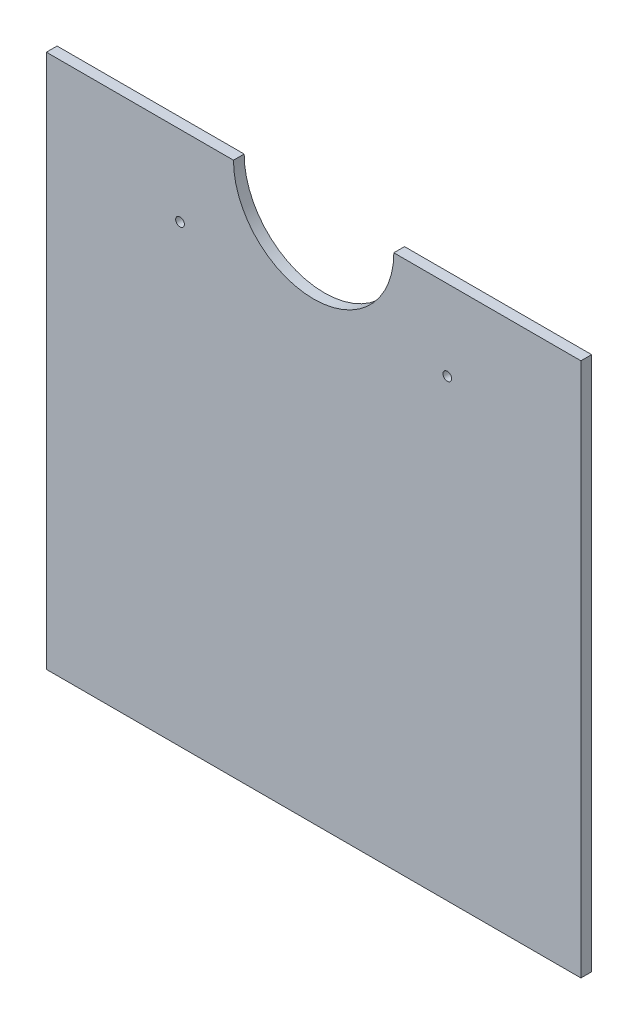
ISO-10303-21;
HEADER;
FILE_DESCRIPTION(('STEP AP214'),'2;1');
FILE_NAME('part.step','',(''),(''),'','','');
FILE_SCHEMA(('AUTOMOTIVE_DESIGN { 1 0 10303 214 1 1 1 1 }'));
ENDSEC;
DATA;
#1=APPLICATION_CONTEXT('core data for automotive mechanical design processes');
#2=APPLICATION_PROTOCOL_DEFINITION('international standard','automotive_design',2000,#1);
#3=PRODUCT_CONTEXT('',#1,'mechanical');
#4=PRODUCT('Part','Part','',(#3));
#5=PRODUCT_RELATED_PRODUCT_CATEGORY('part','',(#4));
#6=PRODUCT_DEFINITION_FORMATION('','',#4);
#7=PRODUCT_DEFINITION_CONTEXT('part definition',#1,'design');
#8=PRODUCT_DEFINITION('design','',#6,#7);
#9=PRODUCT_DEFINITION_SHAPE('','',#8);
#10=(LENGTH_UNIT() NAMED_UNIT(*) SI_UNIT(.MILLI.,.METRE.));
#11=(NAMED_UNIT(*) PLANE_ANGLE_UNIT() SI_UNIT($,.RADIAN.));
#12=(NAMED_UNIT(*) SI_UNIT($,.STERADIAN.) SOLID_ANGLE_UNIT());
#13=UNCERTAINTY_MEASURE_WITH_UNIT(LENGTH_MEASURE(1.E-05),#10,'distance_accuracy_value','');
#14=(GEOMETRIC_REPRESENTATION_CONTEXT(3) GLOBAL_UNCERTAINTY_ASSIGNED_CONTEXT((#13)) GLOBAL_UNIT_ASSIGNED_CONTEXT((#10,
#11,#12)) REPRESENTATION_CONTEXT('',''));
#15=CARTESIAN_POINT('',(0.,0.,0.));
#16=DIRECTION('',(0.,0.,1.));
#17=DIRECTION('',(1.,0.,0.));
#18=AXIS2_PLACEMENT_3D('',#15,#16,#17);
#19=CARTESIAN_POINT('',(0.,80.,8.));
#20=DIRECTION('',(1.,0.,0.));
#21=DIRECTION('',(0.,0.,-1.));
#22=AXIS2_PLACEMENT_3D('',#19,#20,#21);
#23=PLANE('',#22);
#24=DIRECTION('',(0.,-1.,0.));
#25=VECTOR('',#24,1.);
#26=CARTESIAN_POINT('',(0.,80.,0.));
#27=LINE('',#26,#25);
#28=CARTESIAN_POINT('',(0.,480.,0.));
#29=VERTEX_POINT('',#28);
#30=CARTESIAN_POINT('',(0.,80.,0.));
#31=VERTEX_POINT('',#30);
#32=EDGE_CURVE('E89',#29,#31,#27,.T.);
#33=ORIENTED_EDGE('',*,*,#32,.T.);
#34=DIRECTION('',(0.,0.,-1.));
#35=VECTOR('',#34,1.);
#36=CARTESIAN_POINT('',(0.,80.,8.));
#37=LINE('',#36,#35);
#38=CARTESIAN_POINT('',(0.,80.,8.));
#39=VERTEX_POINT('',#38);
#40=EDGE_CURVE('E11',#39,#31,#37,.T.);
#41=ORIENTED_EDGE('',*,*,#40,.F.);
#42=DIRECTION('',(0.,-1.,0.));
#43=VECTOR('',#42,1.);
#44=CARTESIAN_POINT('',(0.,80.,8.));
#45=LINE('',#44,#43);
#46=CARTESIAN_POINT('',(0.,480.,8.));
#47=VERTEX_POINT('',#46);
#48=EDGE_CURVE('E117',#47,#39,#45,.T.);
#49=ORIENTED_EDGE('',*,*,#48,.F.);
#50=DIRECTION('',(0.,0.,-1.));
#51=VECTOR('',#50,1.);
#52=CARTESIAN_POINT('',(0.,480.,8.));
#53=LINE('',#52,#51);
#54=EDGE_CURVE('E102',#47,#29,#53,.T.);
#55=ORIENTED_EDGE('',*,*,#54,.T.);
#56=EDGE_LOOP('',(#33,#41,#49,#55));
#57=FACE_BOUND('',#56,.T.);
#58=ADVANCED_FACE('F31',(#57),#23,.F.);
#59=CARTESIAN_POINT('',(0.,80.,8.));
#60=DIRECTION('',(0.,1.,0.));
#61=DIRECTION('',(0.,0.,1.));
#62=AXIS2_PLACEMENT_3D('',#59,#60,#61);
#63=PLANE('',#62);
#64=DIRECTION('',(1.,0.,0.));
#65=VECTOR('',#64,1.);
#66=CARTESIAN_POINT('',(0.,80.,0.));
#67=LINE('',#66,#65);
#68=CARTESIAN_POINT('',(400.,80.,0.));
#69=VERTEX_POINT('',#68);
#70=EDGE_CURVE('E85',#31,#69,#67,.T.);
#71=ORIENTED_EDGE('',*,*,#70,.T.);
#72=DIRECTION('',(0.,0.,-1.));
#73=VECTOR('',#72,1.);
#74=CARTESIAN_POINT('',(400.,80.,8.));
#75=LINE('',#74,#73);
#76=CARTESIAN_POINT('',(400.,80.,8.));
#77=VERTEX_POINT('',#76);
#78=EDGE_CURVE('E38',#77,#69,#75,.T.);
#79=ORIENTED_EDGE('',*,*,#78,.F.);
#80=DIRECTION('',(1.,0.,0.));
#81=VECTOR('',#80,1.);
#82=CARTESIAN_POINT('',(0.,80.,8.));
#83=LINE('',#82,#81);
#84=EDGE_CURVE('E98',#39,#77,#83,.T.);
#85=ORIENTED_EDGE('',*,*,#84,.F.);
#86=ORIENTED_EDGE('',*,*,#40,.T.);
#87=EDGE_LOOP('',(#71,#79,#85,#86));
#88=FACE_BOUND('',#87,.T.);
#89=ADVANCED_FACE('F97',(#88),#63,.F.);
#90=CARTESIAN_POINT('',(400.,80.,8.));
#91=DIRECTION('',(-1.,0.,0.));
#92=DIRECTION('',(0.,0.,1.));
#93=AXIS2_PLACEMENT_3D('',#90,#91,#92);
#94=PLANE('',#93);
#95=DIRECTION('',(0.,1.,0.));
#96=VECTOR('',#95,1.);
#97=CARTESIAN_POINT('',(400.,80.,0.));
#98=LINE('',#97,#96);
#99=CARTESIAN_POINT('',(400.,480.,0.));
#100=VERTEX_POINT('',#99);
#101=EDGE_CURVE('E91',#69,#100,#98,.T.);
#102=ORIENTED_EDGE('',*,*,#101,.T.);
#103=DIRECTION('',(0.,0.,-1.));
#104=VECTOR('',#103,1.);
#105=CARTESIAN_POINT('',(400.,480.,8.));
#106=LINE('',#105,#104);
#107=CARTESIAN_POINT('',(400.,480.,8.));
#108=VERTEX_POINT('',#107);
#109=EDGE_CURVE('E135',#108,#100,#106,.T.);
#110=ORIENTED_EDGE('',*,*,#109,.F.);
#111=DIRECTION('',(0.,1.,0.));
#112=VECTOR('',#111,1.);
#113=CARTESIAN_POINT('',(400.,80.,8.));
#114=LINE('',#113,#112);
#115=EDGE_CURVE('E121',#77,#108,#114,.T.);
#116=ORIENTED_EDGE('',*,*,#115,.F.);
#117=ORIENTED_EDGE('',*,*,#78,.T.);
#118=EDGE_LOOP('',(#102,#110,#116,#117));
#119=FACE_BOUND('',#118,.T.);
#120=ADVANCED_FACE('F143',(#119),#94,.F.);
#121=CARTESIAN_POINT('',(260.,480.,8.));
#122=DIRECTION('',(0.,-1.,0.));
#123=DIRECTION('',(0.,0.,-1.));
#124=AXIS2_PLACEMENT_3D('',#121,#122,#123);
#125=PLANE('',#124);
#126=DIRECTION('',(-1.,0.,0.));
#127=VECTOR('',#126,1.);
#128=CARTESIAN_POINT('',(260.,480.,0.));
#129=LINE('',#128,#127);
#130=CARTESIAN_POINT('',(260.,480.,0.));
#131=VERTEX_POINT('',#130);
#132=EDGE_CURVE('E111',#100,#131,#129,.T.);
#133=ORIENTED_EDGE('',*,*,#132,.T.);
#134=DIRECTION('',(0.,0.,-1.));
#135=VECTOR('',#134,1.);
#136=CARTESIAN_POINT('',(260.,480.,8.));
#137=LINE('',#136,#135);
#138=CARTESIAN_POINT('',(260.,480.,8.));
#139=VERTEX_POINT('',#138);
#140=EDGE_CURVE('E132',#139,#131,#137,.T.);
#141=ORIENTED_EDGE('',*,*,#140,.F.);
#142=DIRECTION('',(-1.,0.,0.));
#143=VECTOR('',#142,1.);
#144=CARTESIAN_POINT('',(260.,480.,8.));
#145=LINE('',#144,#143);
#146=EDGE_CURVE('E124',#108,#139,#145,.T.);
#147=ORIENTED_EDGE('',*,*,#146,.F.);
#148=ORIENTED_EDGE('',*,*,#109,.T.);
#149=EDGE_LOOP('',(#133,#141,#147,#148));
#150=FACE_BOUND('',#149,.T.);
#151=ADVANCED_FACE('F149',(#150),#125,.F.);
#152=CARTESIAN_POINT('',(200.,480.,8.));
#153=DIRECTION('',(0.,0.,-1.));
#154=DIRECTION('',(-1.,0.,0.));
#155=AXIS2_PLACEMENT_3D('',#152,#153,#154);
#156=CYLINDRICAL_SURFACE('',#155,60.);
#157=CARTESIAN_POINT('',(200.,480.,0.));
#158=DIRECTION('',(0.,0.,-1.));
#159=DIRECTION('',(1.,0.,0.));
#160=AXIS2_PLACEMENT_3D('',#157,#158,#159);
#161=CIRCLE('',#160,60.);
#162=CARTESIAN_POINT('',(140.,480.,0.));
#163=VERTEX_POINT('',#162);
#164=EDGE_CURVE('E113',#131,#163,#161,.T.);
#165=ORIENTED_EDGE('',*,*,#164,.T.);
#166=DIRECTION('',(0.,0.,-1.));
#167=VECTOR('',#166,1.);
#168=CARTESIAN_POINT('',(140.,480.,8.));
#169=LINE('',#168,#167);
#170=CARTESIAN_POINT('',(140.,480.,8.));
#171=VERTEX_POINT('',#170);
#172=EDGE_CURVE('E129',#171,#163,#169,.T.);
#173=ORIENTED_EDGE('',*,*,#172,.F.);
#174=CARTESIAN_POINT('',(200.,480.,8.));
#175=DIRECTION('',(0.,0.,-1.));
#176=DIRECTION('',(1.,0.,0.));
#177=AXIS2_PLACEMENT_3D('',#174,#175,#176);
#178=CIRCLE('',#177,60.);
#179=EDGE_CURVE('E50',#139,#171,#178,.T.);
#180=ORIENTED_EDGE('',*,*,#179,.F.);
#181=ORIENTED_EDGE('',*,*,#140,.T.);
#182=EDGE_LOOP('',(#165,#173,#180,#181));
#183=FACE_BOUND('',#182,.T.);
#184=ADVANCED_FACE('F152',(#183),#156,.F.);
#185=CARTESIAN_POINT('',(0.,480.,8.));
#186=DIRECTION('',(0.,-1.,0.));
#187=DIRECTION('',(0.,0.,-1.));
#188=AXIS2_PLACEMENT_3D('',#185,#186,#187);
#189=PLANE('',#188);
#190=DIRECTION('',(-1.,0.,0.));
#191=VECTOR('',#190,1.);
#192=CARTESIAN_POINT('',(0.,480.,0.));
#193=LINE('',#192,#191);
#194=EDGE_CURVE('E115',#163,#29,#193,.T.);
#195=ORIENTED_EDGE('',*,*,#194,.T.);
#196=ORIENTED_EDGE('',*,*,#54,.F.);
#197=DIRECTION('',(-1.,0.,0.));
#198=VECTOR('',#197,1.);
#199=CARTESIAN_POINT('',(0.,480.,8.));
#200=LINE('',#199,#198);
#201=EDGE_CURVE('E45',#171,#47,#200,.T.);
#202=ORIENTED_EDGE('',*,*,#201,.F.);
#203=ORIENTED_EDGE('',*,*,#172,.T.);
#204=EDGE_LOOP('',(#195,#196,#202,#203));
#205=FACE_BOUND('',#204,.T.);
#206=ADVANCED_FACE('F154',(#205),#189,.F.);
#207=CARTESIAN_POINT('',(200.,480.,8.));
#208=DIRECTION('',(0.,0.,1.));
#209=DIRECTION('',(1.,0.,0.));
#210=AXIS2_PLACEMENT_3D('',#207,#208,#209);
#211=PLANE('',#210);
#212=CARTESIAN_POINT('',(300.,420.,8.));
#213=DIRECTION('',(0.,0.,1.));
#214=DIRECTION('',(1.,0.,0.));
#215=AXIS2_PLACEMENT_3D('',#212,#213,#214);
#216=CIRCLE('',#215,3.24999999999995);
#217=CARTESIAN_POINT('',(303.25,420.,8.));
#218=VERTEX_POINT('',#217);
#219=EDGE_CURVE('E220',#218,#218,#216,.T.);
#220=ORIENTED_EDGE('',*,*,#219,.F.);
#221=EDGE_LOOP('',(#220));
#222=FACE_BOUND('',#221,.T.);
#223=CARTESIAN_POINT('',(100.,420.,8.));
#224=DIRECTION('',(0.,0.,1.));
#225=DIRECTION('',(1.,0.,0.));
#226=AXIS2_PLACEMENT_3D('',#223,#224,#225);
#227=CIRCLE('',#226,3.25000000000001);
#228=CARTESIAN_POINT('',(103.25,420.,8.));
#229=VERTEX_POINT('',#228);
#230=EDGE_CURVE('E106',#229,#229,#227,.T.);
#231=ORIENTED_EDGE('',*,*,#230,.F.);
#232=EDGE_LOOP('',(#231));
#233=FACE_BOUND('',#232,.T.);
#234=ORIENTED_EDGE('',*,*,#48,.T.);
#235=ORIENTED_EDGE('',*,*,#84,.T.);
#236=ORIENTED_EDGE('',*,*,#115,.T.);
#237=ORIENTED_EDGE('',*,*,#146,.T.);
#238=ORIENTED_EDGE('',*,*,#179,.T.);
#239=ORIENTED_EDGE('',*,*,#201,.T.);
#240=EDGE_LOOP('',(#234,#235,#236,#237,#238,#239));
#241=FACE_BOUND('',#240,.T.);
#242=ADVANCED_FACE('F146',(#222,#233,#241),#211,.T.);
#243=CARTESIAN_POINT('',(200.,480.,0.));
#244=DIRECTION('',(0.,0.,1.));
#245=DIRECTION('',(1.,0.,0.));
#246=AXIS2_PLACEMENT_3D('',#243,#244,#245);
#247=PLANE('',#246);
#248=CARTESIAN_POINT('',(300.,420.,0.));
#249=DIRECTION('',(0.,0.,1.));
#250=DIRECTION('',(1.,0.,0.));
#251=AXIS2_PLACEMENT_3D('',#248,#249,#250);
#252=CIRCLE('',#251,3.24999999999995);
#253=CARTESIAN_POINT('',(303.25,420.,0.));
#254=VERTEX_POINT('',#253);
#255=EDGE_CURVE('E217',#254,#254,#252,.T.);
#256=ORIENTED_EDGE('',*,*,#255,.T.);
#257=EDGE_LOOP('',(#256));
#258=FACE_BOUND('',#257,.T.);
#259=CARTESIAN_POINT('',(100.,420.,0.));
#260=DIRECTION('',(0.,0.,1.));
#261=DIRECTION('',(1.,0.,0.));
#262=AXIS2_PLACEMENT_3D('',#259,#260,#261);
#263=CIRCLE('',#262,3.25000000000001);
#264=CARTESIAN_POINT('',(103.25,420.,0.));
#265=VERTEX_POINT('',#264);
#266=EDGE_CURVE('E103',#265,#265,#263,.T.);
#267=ORIENTED_EDGE('',*,*,#266,.T.);
#268=EDGE_LOOP('',(#267));
#269=FACE_BOUND('',#268,.T.);
#270=ORIENTED_EDGE('',*,*,#32,.F.);
#271=ORIENTED_EDGE('',*,*,#194,.F.);
#272=ORIENTED_EDGE('',*,*,#164,.F.);
#273=ORIENTED_EDGE('',*,*,#132,.F.);
#274=ORIENTED_EDGE('',*,*,#101,.F.);
#275=ORIENTED_EDGE('',*,*,#70,.F.);
#276=EDGE_LOOP('',(#270,#271,#272,#273,#274,#275));
#277=FACE_BOUND('',#276,.T.);
#278=ADVANCED_FACE('F86',(#258,#269,#277),#247,.F.);
#279=CARTESIAN_POINT('',(100.,420.,0.));
#280=DIRECTION('',(0.,0.,1.));
#281=DIRECTION('',(1.,0.,0.));
#282=AXIS2_PLACEMENT_3D('',#279,#280,#281);
#283=CYLINDRICAL_SURFACE('',#282,3.25000000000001);
#284=ORIENTED_EDGE('',*,*,#266,.F.);
#285=EDGE_LOOP('',(#284));
#286=FACE_BOUND('',#285,.T.);
#287=ORIENTED_EDGE('',*,*,#230,.T.);
#288=EDGE_LOOP('',(#287));
#289=FACE_BOUND('',#288,.T.);
#290=ADVANCED_FACE('F196',(#286,#289),#283,.F.);
#291=CARTESIAN_POINT('',(300.,420.,0.));
#292=DIRECTION('',(0.,0.,1.));
#293=DIRECTION('',(1.,0.,0.));
#294=AXIS2_PLACEMENT_3D('',#291,#292,#293);
#295=CYLINDRICAL_SURFACE('',#294,3.24999999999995);
#296=ORIENTED_EDGE('',*,*,#255,.F.);
#297=EDGE_LOOP('',(#296));
#298=FACE_BOUND('',#297,.T.);
#299=ORIENTED_EDGE('',*,*,#219,.T.);
#300=EDGE_LOOP('',(#299));
#301=FACE_BOUND('',#300,.T.);
#302=ADVANCED_FACE('F204',(#298,#301),#295,.F.);
#303=CLOSED_SHELL('',(#58,#89,#120,#151,#184,#206,#242,#278,#290,#302));
#304=MANIFOLD_SOLID_BREP('B2',#303);
#305=ADVANCED_BREP_SHAPE_REPRESENTATION('',(#18,#304),#14);
#306=SHAPE_DEFINITION_REPRESENTATION(#9,#305);
ENDSEC;
END-ISO-10303-21;
